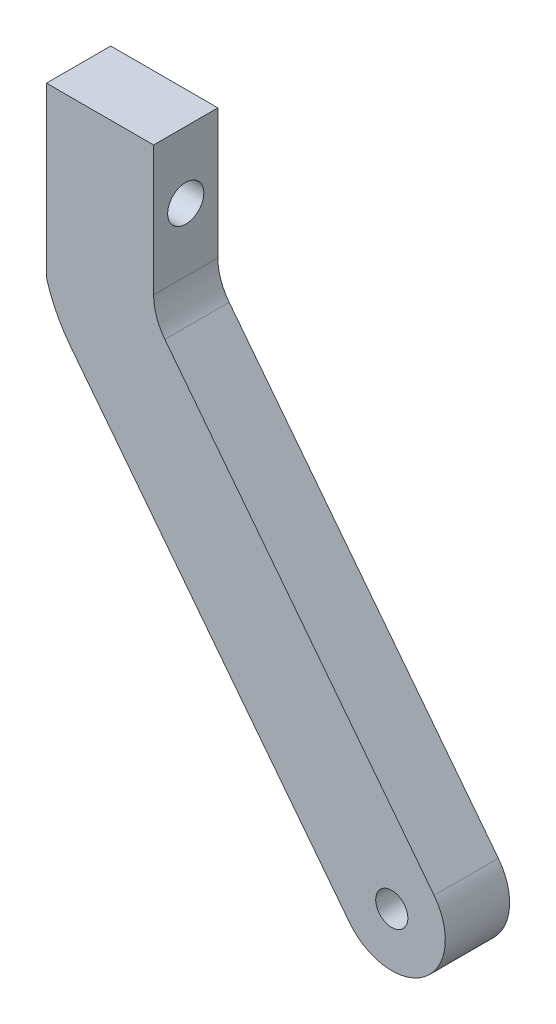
from build123d import *

# Parameters (mm, degrees)
ESQUISSE1_R                  = 3
BASE_EXTRUSION_DEPTH         = 6
ESQUISSE3_R                  = 3.375
ENL_V_MAT_EXTRU_1_DEPTH      = 21
ENL_V_MAT_EXTRU_2_DEPTH      = 125.49721764
ENL_V_MAT_EXTRU_2_DEPTH_BACK = 125.49721764
ESQUISSE4_W                  = 1
ESQUISSE4_H                  = 31.424736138


with BuildPart() as part:
    # Esquisse1 → Base-Extrusion (new, symmetric)
    with BuildSketch(Plane.XY):
        with BuildLine():
            Line((21, 12.43), (21, -11.82))
            ThreePointArc((21, -11.82), (21.539593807, -15.060480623), (23.100142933, -17.95125259))
            Line((23.100142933, -17.95125259), (73.359857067, -82.70874741))
            ThreePointArc((73.359857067, -82.70874741), (71.59125259, -96.739857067), (57.560142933, -94.97125259))
            Line((57.560142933, -94.97125259), (5.510443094, -27.907437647))
            ThreePointArc((5.510443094, -27.907437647), (1.415808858, -20.322508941), (0, -11.82))
            Line((0, -11.82), (0, 12.43))
            Line((0, 12.43), (21, 12.43))
        make_face()
        with Locations((65.46, -88.84)):
            Circle(ESQUISSE1_R, mode=Mode.SUBTRACT)
    extrude(amount=BASE_EXTRUSION_DEPTH, both=True)

    # Esquisse3 → Enl_v. mat.-Extru.1 (cut)
    with BuildSketch(Plane.ZY):
        with Locations(Location((0, 0, 0), (0, 0, 180))):
            Circle(ESQUISSE3_R)
    extrude(amount=-ENL_V_MAT_EXTRU_1_DEPTH, mode=Mode.SUBTRACT)

    # Esquisse4 → Enl_v. mat.-Extru.2 (cut, two sides: drawn at the far end of the back side and taken through both)
    with BuildSketch(Plane.XY.offset(-ENL_V_MAT_EXTRU_2_DEPTH_BACK)):
        with Locations((0.5, -3.282368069)):
            Rectangle(ESQUISSE4_W, ESQUISSE4_H)
    extrude(amount=ENL_V_MAT_EXTRU_2_DEPTH + ENL_V_MAT_EXTRU_2_DEPTH_BACK, mode=Mode.SUBTRACT)


solid = part.part
